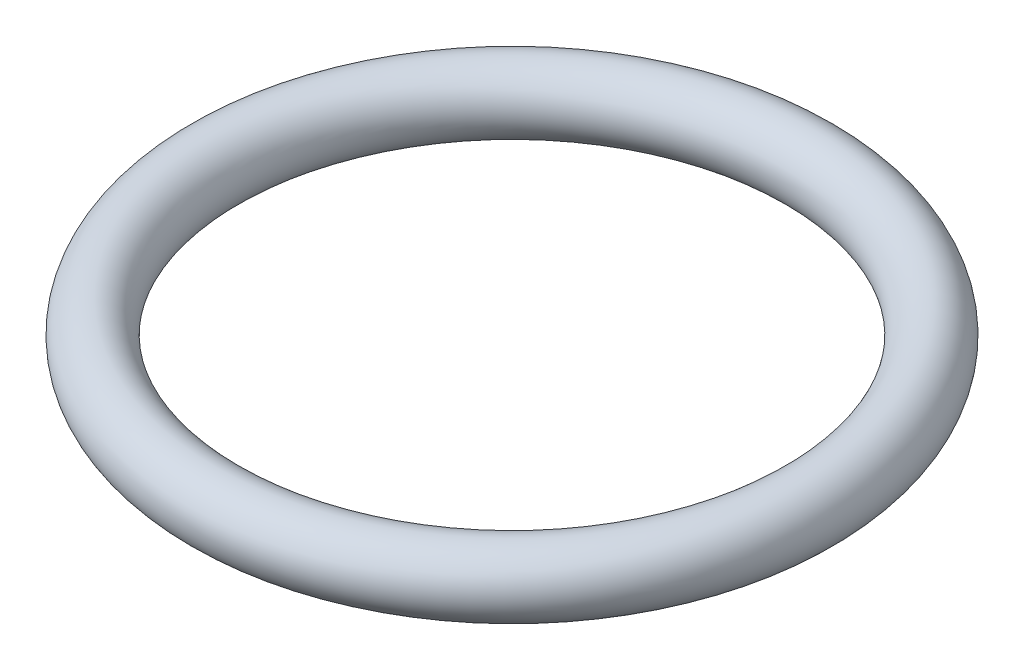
ISO-10303-21;
HEADER;
FILE_DESCRIPTION(('STEP AP214'),'2;1');
FILE_NAME('part.step','',(''),(''),'','','');
FILE_SCHEMA(('AUTOMOTIVE_DESIGN { 1 0 10303 214 1 1 1 1 }'));
ENDSEC;
DATA;
#1=APPLICATION_CONTEXT('core data for automotive mechanical design processes');
#2=APPLICATION_PROTOCOL_DEFINITION('international standard','automotive_design',2000,#1);
#3=PRODUCT_CONTEXT('',#1,'mechanical');
#4=PRODUCT('Part','Part','',(#3));
#5=PRODUCT_RELATED_PRODUCT_CATEGORY('part','',(#4));
#6=PRODUCT_DEFINITION_FORMATION('','',#4);
#7=PRODUCT_DEFINITION_CONTEXT('part definition',#1,'design');
#8=PRODUCT_DEFINITION('design','',#6,#7);
#9=PRODUCT_DEFINITION_SHAPE('','',#8);
#10=(LENGTH_UNIT() NAMED_UNIT(*) SI_UNIT(.MILLI.,.METRE.));
#11=(NAMED_UNIT(*) PLANE_ANGLE_UNIT() SI_UNIT($,.RADIAN.));
#12=(NAMED_UNIT(*) SI_UNIT($,.STERADIAN.) SOLID_ANGLE_UNIT());
#13=UNCERTAINTY_MEASURE_WITH_UNIT(LENGTH_MEASURE(1.E-05),#10,'distance_accuracy_value','');
#14=(GEOMETRIC_REPRESENTATION_CONTEXT(3) GLOBAL_UNCERTAINTY_ASSIGNED_CONTEXT((#13)) GLOBAL_UNIT_ASSIGNED_CONTEXT((#10,
#11,#12)) REPRESENTATION_CONTEXT('',''));
#15=CARTESIAN_POINT('',(0.,0.,0.));
#16=DIRECTION('',(0.,0.,1.));
#17=DIRECTION('',(1.,0.,0.));
#18=AXIS2_PLACEMENT_3D('',#15,#16,#17);
#19=CARTESIAN_POINT('',(0.,0.,0.));
#20=DIRECTION('',(0.,-1.,0.));
#21=DIRECTION('',(0.,0.,-1.));
#22=AXIS2_PLACEMENT_3D('',#19,#20,#21);
#23=TOROIDAL_SURFACE('',#22,18.,2.);
#24=CARTESIAN_POINT('',(0.,0.,-20.));
#25=VERTEX_POINT('',#24);
#26=VERTEX_LOOP('',#25);
#27=FACE_BOUND('',#26,.T.);
#28=ADVANCED_FACE('F27',(#27),#23,.T.);
#29=CLOSED_SHELL('',(#28));
#30=MANIFOLD_SOLID_BREP('B2',#29);
#31=ADVANCED_BREP_SHAPE_REPRESENTATION('',(#18,#30),#14);
#32=SHAPE_DEFINITION_REPRESENTATION(#9,#31);
ENDSEC;
END-ISO-10303-21;
